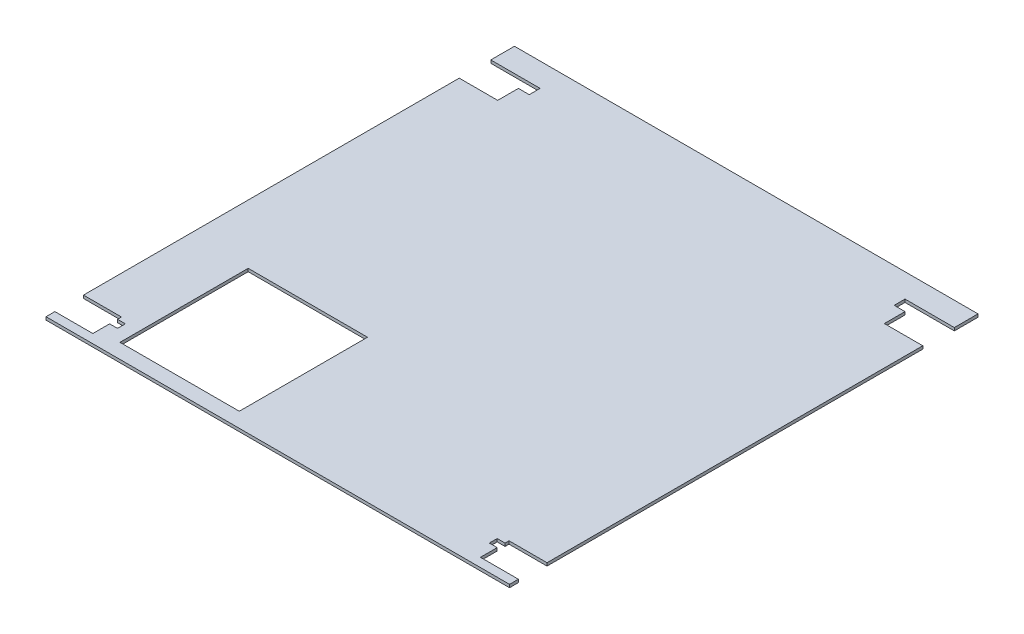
ISO-10303-21;
HEADER;
FILE_DESCRIPTION(('STEP AP214'),'2;1');
FILE_NAME('part.step','',(''),(''),'','','');
FILE_SCHEMA(('AUTOMOTIVE_DESIGN { 1 0 10303 214 1 1 1 1 }'));
ENDSEC;
DATA;
#1=APPLICATION_CONTEXT('core data for automotive mechanical design processes');
#2=APPLICATION_PROTOCOL_DEFINITION('international standard','automotive_design',2000,#1);
#3=PRODUCT_CONTEXT('',#1,'mechanical');
#4=PRODUCT('Part','Part','',(#3));
#5=PRODUCT_RELATED_PRODUCT_CATEGORY('part','',(#4));
#6=PRODUCT_DEFINITION_FORMATION('','',#4);
#7=PRODUCT_DEFINITION_CONTEXT('part definition',#1,'design');
#8=PRODUCT_DEFINITION('design','',#6,#7);
#9=PRODUCT_DEFINITION_SHAPE('','',#8);
#10=(LENGTH_UNIT() NAMED_UNIT(*) SI_UNIT(.MILLI.,.METRE.));
#11=(NAMED_UNIT(*) PLANE_ANGLE_UNIT() SI_UNIT($,.RADIAN.));
#12=(NAMED_UNIT(*) SI_UNIT($,.STERADIAN.) SOLID_ANGLE_UNIT());
#13=UNCERTAINTY_MEASURE_WITH_UNIT(LENGTH_MEASURE(1.E-05),#10,'distance_accuracy_value','');
#14=(GEOMETRIC_REPRESENTATION_CONTEXT(3) GLOBAL_UNCERTAINTY_ASSIGNED_CONTEXT((#13)) GLOBAL_UNIT_ASSIGNED_CONTEXT((#10,
#11,#12)) REPRESENTATION_CONTEXT('',''));
#15=CARTESIAN_POINT('',(0.,0.,0.));
#16=DIRECTION('',(0.,0.,1.));
#17=DIRECTION('',(1.,0.,0.));
#18=AXIS2_PLACEMENT_3D('',#15,#16,#17);
#19=CARTESIAN_POINT('',(0.,3.,0.));
#20=DIRECTION('',(0.,-1.,0.));
#21=DIRECTION('',(0.,0.,-1.));
#22=AXIS2_PLACEMENT_3D('',#19,#20,#21);
#23=PLANE('',#22);
#24=DIRECTION('',(0.,0.,1.));
#25=VECTOR('',#24,1.);
#26=CARTESIAN_POINT('',(420.,3.,0.));
#27=LINE('',#26,#25);
#28=CARTESIAN_POINT('',(420.,3.,-451.));
#29=VERTEX_POINT('',#28);
#30=CARTESIAN_POINT('',(420.,3.,-440.));
#31=VERTEX_POINT('',#30);
#32=EDGE_CURVE('E298',#29,#31,#27,.T.);
#33=ORIENTED_EDGE('',*,*,#32,.F.);
#34=DIRECTION('',(-1.,0.,0.));
#35=VECTOR('',#34,1.);
#36=CARTESIAN_POINT('',(470.,3.,-451.));
#37=LINE('',#36,#35);
#38=CARTESIAN_POINT('',(470.,3.,-451.));
#39=VERTEX_POINT('',#38);
#40=EDGE_CURVE('E295',#39,#29,#37,.T.);
#41=ORIENTED_EDGE('',*,*,#40,.F.);
#42=DIRECTION('',(0.,0.,-1.));
#43=VECTOR('',#42,1.);
#44=CARTESIAN_POINT('',(470.,3.,0.));
#45=LINE('',#44,#43);
#46=CARTESIAN_POINT('',(470.,3.,-475.));
#47=VERTEX_POINT('',#46);
#48=EDGE_CURVE('E803',#39,#47,#45,.T.);
#49=ORIENTED_EDGE('',*,*,#48,.T.);
#50=DIRECTION('',(-1.,0.,0.));
#51=VECTOR('',#50,1.);
#52=CARTESIAN_POINT('',(0.,3.,-475.));
#53=LINE('',#52,#51);
#54=CARTESIAN_POINT('',(0.,3.,-475.));
#55=VERTEX_POINT('',#54);
#56=EDGE_CURVE('E777',#47,#55,#53,.T.);
#57=ORIENTED_EDGE('',*,*,#56,.T.);
#58=DIRECTION('',(0.,0.,1.));
#59=VECTOR('',#58,1.);
#60=CARTESIAN_POINT('',(0.,3.,0.));
#61=LINE('',#60,#59);
#62=CARTESIAN_POINT('',(0.,3.,-451.));
#63=VERTEX_POINT('',#62);
#64=EDGE_CURVE('E441',#55,#63,#61,.T.);
#65=ORIENTED_EDGE('',*,*,#64,.T.);
#66=DIRECTION('',(1.,0.,0.));
#67=VECTOR('',#66,1.);
#68=CARTESIAN_POINT('',(0.,3.,-451.));
#69=LINE('',#68,#67);
#70=CARTESIAN_POINT('',(50.,3.,-451.));
#71=VERTEX_POINT('',#70);
#72=EDGE_CURVE('E362',#63,#71,#69,.T.);
#73=ORIENTED_EDGE('',*,*,#72,.T.);
#74=DIRECTION('',(0.,0.,1.));
#75=VECTOR('',#74,1.);
#76=CARTESIAN_POINT('',(50.,3.,0.));
#77=LINE('',#76,#75);
#78=CARTESIAN_POINT('',(50.,3.,-440.));
#79=VERTEX_POINT('',#78);
#80=EDGE_CURVE('E357',#71,#79,#77,.T.);
#81=ORIENTED_EDGE('',*,*,#80,.T.);
#82=DIRECTION('',(1.,0.,0.));
#83=VECTOR('',#82,1.);
#84=CARTESIAN_POINT('',(0.,3.,-440.));
#85=LINE('',#84,#83);
#86=CARTESIAN_POINT('',(39.,3.,-440.));
#87=VERTEX_POINT('',#86);
#88=EDGE_CURVE('E374',#87,#79,#85,.T.);
#89=ORIENTED_EDGE('',*,*,#88,.F.);
#90=DIRECTION('',(0.,0.,1.));
#91=VECTOR('',#90,1.);
#92=CARTESIAN_POINT('',(39.0000000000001,3.,0.));
#93=LINE('',#92,#91);
#94=CARTESIAN_POINT('',(39.,3.,-419.));
#95=VERTEX_POINT('',#94);
#96=EDGE_CURVE('E380',#87,#95,#93,.T.);
#97=ORIENTED_EDGE('',*,*,#96,.T.);
#98=DIRECTION('',(1.,0.,0.));
#99=VECTOR('',#98,1.);
#100=CARTESIAN_POINT('',(0.,3.,-419.));
#101=LINE('',#100,#99);
#102=CARTESIAN_POINT('',(0.,3.,-419.));
#103=VERTEX_POINT('',#102);
#104=EDGE_CURVE('E823',#103,#95,#101,.T.);
#105=ORIENTED_EDGE('',*,*,#104,.F.);
#106=CARTESIAN_POINT('',(0.,3.,-38.));
#107=VERTEX_POINT('',#106);
#108=EDGE_CURVE('E447',#103,#107,#61,.T.);
#109=ORIENTED_EDGE('',*,*,#108,.T.);
#110=DIRECTION('',(1.,0.,0.));
#111=VECTOR('',#110,1.);
#112=CARTESIAN_POINT('',(0.,3.,-38.));
#113=LINE('',#112,#111);
#114=CARTESIAN_POINT('',(38.5,3.,-38.));
#115=VERTEX_POINT('',#114);
#116=EDGE_CURVE('E363',#107,#115,#113,.T.);
#117=ORIENTED_EDGE('',*,*,#116,.T.);
#118=DIRECTION('',(0.,0.,-1.));
#119=VECTOR('',#118,1.);
#120=CARTESIAN_POINT('',(38.5,3.,-34.));
#121=LINE('',#120,#119);
#122=CARTESIAN_POINT('',(38.5,3.,-34.));
#123=VERTEX_POINT('',#122);
#124=EDGE_CURVE('E462',#123,#115,#121,.T.);
#125=ORIENTED_EDGE('',*,*,#124,.F.);
#126=DIRECTION('',(1.,0.,0.));
#127=VECTOR('',#126,1.);
#128=CARTESIAN_POINT('',(38.5,3.,-34.));
#129=LINE('',#128,#127);
#130=CARTESIAN_POINT('',(46.5,3.,-34.));
#131=VERTEX_POINT('',#130);
#132=EDGE_CURVE('E466',#123,#131,#129,.T.);
#133=ORIENTED_EDGE('',*,*,#132,.T.);
#134=DIRECTION('',(0.,0.,1.));
#135=VECTOR('',#134,1.);
#136=CARTESIAN_POINT('',(46.5,3.,-34.));
#137=LINE('',#136,#135);
#138=CARTESIAN_POINT('',(46.5,3.,-26.));
#139=VERTEX_POINT('',#138);
#140=EDGE_CURVE('E471',#131,#139,#137,.T.);
#141=ORIENTED_EDGE('',*,*,#140,.T.);
#142=DIRECTION('',(1.,0.,0.));
#143=VECTOR('',#142,1.);
#144=CARTESIAN_POINT('',(38.5,3.,-26.));
#145=LINE('',#144,#143);
#146=CARTESIAN_POINT('',(38.5,3.,-26.));
#147=VERTEX_POINT('',#146);
#148=EDGE_CURVE('E475',#147,#139,#145,.T.);
#149=ORIENTED_EDGE('',*,*,#148,.F.);
#150=DIRECTION('',(0.,0.,-1.));
#151=VECTOR('',#150,1.);
#152=CARTESIAN_POINT('',(38.5,3.,-9.));
#153=LINE('',#152,#151);
#154=CARTESIAN_POINT('',(38.5,3.,-9.));
#155=VERTEX_POINT('',#154);
#156=EDGE_CURVE('E430',#155,#147,#153,.T.);
#157=ORIENTED_EDGE('',*,*,#156,.F.);
#158=DIRECTION('',(1.,0.,0.));
#159=VECTOR('',#158,1.);
#160=CARTESIAN_POINT('',(0.,3.,-9.));
#161=LINE('',#160,#159);
#162=CARTESIAN_POINT('',(0.,3.,-9.));
#163=VERTEX_POINT('',#162);
#164=EDGE_CURVE('E425',#163,#155,#161,.T.);
#165=ORIENTED_EDGE('',*,*,#164,.F.);
#166=CARTESIAN_POINT('',(0.,3.,0.));
#167=VERTEX_POINT('',#166);
#168=EDGE_CURVE('E448',#163,#167,#61,.T.);
#169=ORIENTED_EDGE('',*,*,#168,.T.);
#170=DIRECTION('',(1.,0.,0.));
#171=VECTOR('',#170,1.);
#172=CARTESIAN_POINT('',(0.,3.,0.));
#173=LINE('',#172,#171);
#174=CARTESIAN_POINT('',(470.,3.,0.));
#175=VERTEX_POINT('',#174);
#176=EDGE_CURVE('E446',#167,#175,#173,.T.);
#177=ORIENTED_EDGE('',*,*,#176,.T.);
#178=CARTESIAN_POINT('',(470.,3.,-9.));
#179=VERTEX_POINT('',#178);
#180=EDGE_CURVE('E757',#175,#179,#45,.T.);
#181=ORIENTED_EDGE('',*,*,#180,.T.);
#182=DIRECTION('',(-1.,0.,0.));
#183=VECTOR('',#182,1.);
#184=CARTESIAN_POINT('',(470.,3.,-9.));
#185=LINE('',#184,#183);
#186=CARTESIAN_POINT('',(431.5,3.,-9.));
#187=VERTEX_POINT('',#186);
#188=EDGE_CURVE('E614',#179,#187,#185,.T.);
#189=ORIENTED_EDGE('',*,*,#188,.T.);
#190=DIRECTION('',(0.,0.,-1.));
#191=VECTOR('',#190,1.);
#192=CARTESIAN_POINT('',(431.5,3.,-9.));
#193=LINE('',#192,#191);
#194=CARTESIAN_POINT('',(431.5,3.,-26.));
#195=VERTEX_POINT('',#194);
#196=EDGE_CURVE('E619',#187,#195,#193,.T.);
#197=ORIENTED_EDGE('',*,*,#196,.T.);
#198=DIRECTION('',(-1.,0.,0.));
#199=VECTOR('',#198,1.);
#200=CARTESIAN_POINT('',(431.5,3.,-26.));
#201=LINE('',#200,#199);
#202=CARTESIAN_POINT('',(423.5,3.,-26.));
#203=VERTEX_POINT('',#202);
#204=EDGE_CURVE('E628',#195,#203,#201,.T.);
#205=ORIENTED_EDGE('',*,*,#204,.T.);
#206=DIRECTION('',(0.,0.,1.));
#207=VECTOR('',#206,1.);
#208=CARTESIAN_POINT('',(423.5,3.,-34.));
#209=LINE('',#208,#207);
#210=CARTESIAN_POINT('',(423.5,3.,-34.));
#211=VERTEX_POINT('',#210);
#212=EDGE_CURVE('E632',#211,#203,#209,.T.);
#213=ORIENTED_EDGE('',*,*,#212,.F.);
#214=DIRECTION('',(-1.,0.,0.));
#215=VECTOR('',#214,1.);
#216=CARTESIAN_POINT('',(431.5,3.,-34.));
#217=LINE('',#216,#215);
#218=CARTESIAN_POINT('',(431.5,3.,-34.));
#219=VERTEX_POINT('',#218);
#220=EDGE_CURVE('E637',#219,#211,#217,.T.);
#221=ORIENTED_EDGE('',*,*,#220,.F.);
#222=DIRECTION('',(0.,0.,-1.));
#223=VECTOR('',#222,1.);
#224=CARTESIAN_POINT('',(431.5,3.,-34.));
#225=LINE('',#224,#223);
#226=CARTESIAN_POINT('',(431.5,3.,-38.));
#227=VERTEX_POINT('',#226);
#228=EDGE_CURVE('E642',#219,#227,#225,.T.);
#229=ORIENTED_EDGE('',*,*,#228,.T.);
#230=DIRECTION('',(-1.,0.,0.));
#231=VECTOR('',#230,1.);
#232=CARTESIAN_POINT('',(470.,3.,-38.));
#233=LINE('',#232,#231);
#234=CARTESIAN_POINT('',(470.,3.,-38.));
#235=VERTEX_POINT('',#234);
#236=EDGE_CURVE('E648',#235,#227,#233,.T.);
#237=ORIENTED_EDGE('',*,*,#236,.F.);
#238=CARTESIAN_POINT('',(470.,3.,-419.));
#239=VERTEX_POINT('',#238);
#240=EDGE_CURVE('E802',#235,#239,#45,.T.);
#241=ORIENTED_EDGE('',*,*,#240,.T.);
#242=DIRECTION('',(-1.,0.,0.));
#243=VECTOR('',#242,1.);
#244=CARTESIAN_POINT('',(470.,3.,-419.));
#245=LINE('',#244,#243);
#246=CARTESIAN_POINT('',(431.,3.,-419.));
#247=VERTEX_POINT('',#246);
#248=EDGE_CURVE('E64',#239,#247,#245,.T.);
#249=ORIENTED_EDGE('',*,*,#248,.T.);
#250=DIRECTION('',(0.,0.,1.));
#251=VECTOR('',#250,1.);
#252=CARTESIAN_POINT('',(431.,3.,0.));
#253=LINE('',#252,#251);
#254=CARTESIAN_POINT('',(431.,3.,-440.));
#255=VERTEX_POINT('',#254);
#256=EDGE_CURVE('E310',#255,#247,#253,.T.);
#257=ORIENTED_EDGE('',*,*,#256,.F.);
#258=DIRECTION('',(-1.,0.,0.));
#259=VECTOR('',#258,1.);
#260=CARTESIAN_POINT('',(470.,3.,-440.));
#261=LINE('',#260,#259);
#262=EDGE_CURVE('E287',#255,#31,#261,.T.);
#263=ORIENTED_EDGE('',*,*,#262,.T.);
#264=EDGE_LOOP('',(#33,#41,#49,#57,#65,#73,#81,#89,#97,#105,#109,#117,#125,#133,#141,#149,#157,
#165,#169,#177,#181,#189,#197,#205,#213,#221,#229,#237,#241,#249,#257,#263));
#265=FACE_BOUND('',#264,.T.);
#266=DIRECTION('',(1.,0.,0.));
#267=VECTOR('',#266,1.);
#268=CARTESIAN_POINT('',(60.,3.,-15.));
#269=LINE('',#268,#267);
#270=CARTESIAN_POINT('',(60.,3.,-15.));
#271=VERTEX_POINT('',#270);
#272=CARTESIAN_POINT('',(181.,3.,-15.));
#273=VERTEX_POINT('',#272);
#274=EDGE_CURVE('E326',#271,#273,#269,.T.);
#275=ORIENTED_EDGE('',*,*,#274,.F.);
#276=DIRECTION('',(0.,0.,1.));
#277=VECTOR('',#276,1.);
#278=CARTESIAN_POINT('',(60.,3.,-145.));
#279=LINE('',#278,#277);
#280=CARTESIAN_POINT('',(60.,3.,-145.));
#281=VERTEX_POINT('',#280);
#282=EDGE_CURVE('E331',#281,#271,#279,.T.);
#283=ORIENTED_EDGE('',*,*,#282,.F.);
#284=DIRECTION('',(-1.,0.,0.));
#285=VECTOR('',#284,1.);
#286=CARTESIAN_POINT('',(60.,3.,-145.));
#287=LINE('',#286,#285);
#288=CARTESIAN_POINT('',(181.,3.,-145.));
#289=VERTEX_POINT('',#288);
#290=EDGE_CURVE('E338',#289,#281,#287,.T.);
#291=ORIENTED_EDGE('',*,*,#290,.F.);
#292=DIRECTION('',(0.,0.,-1.));
#293=VECTOR('',#292,1.);
#294=CARTESIAN_POINT('',(181.,3.,-145.));
#295=LINE('',#294,#293);
#296=EDGE_CURVE('E330',#273,#289,#295,.T.);
#297=ORIENTED_EDGE('',*,*,#296,.F.);
#298=EDGE_LOOP('',(#275,#283,#291,#297));
#299=FACE_BOUND('',#298,.T.);
#300=ADVANCED_FACE('F48',(#265,#299),#23,.F.);
#301=CARTESIAN_POINT('',(0.,0.,0.));
#302=DIRECTION('',(0.,-1.,0.));
#303=DIRECTION('',(0.,0.,-1.));
#304=AXIS2_PLACEMENT_3D('',#301,#302,#303);
#305=PLANE('',#304);
#306=DIRECTION('',(1.,0.,0.));
#307=VECTOR('',#306,1.);
#308=CARTESIAN_POINT('',(0.,0.,-451.));
#309=LINE('',#308,#307);
#310=CARTESIAN_POINT('',(420.,0.,-451.));
#311=VERTEX_POINT('',#310);
#312=CARTESIAN_POINT('',(470.,0.,-451.));
#313=VERTEX_POINT('',#312);
#314=EDGE_CURVE('E601',#311,#313,#309,.T.);
#315=ORIENTED_EDGE('',*,*,#314,.F.);
#316=DIRECTION('',(0.,0.,-1.));
#317=VECTOR('',#316,1.);
#318=CARTESIAN_POINT('',(420.,0.,0.));
#319=LINE('',#318,#317);
#320=CARTESIAN_POINT('',(420.,0.,-440.));
#321=VERTEX_POINT('',#320);
#322=EDGE_CURVE('E12',#321,#311,#319,.T.);
#323=ORIENTED_EDGE('',*,*,#322,.F.);
#324=DIRECTION('',(1.,0.,0.));
#325=VECTOR('',#324,1.);
#326=CARTESIAN_POINT('',(0.,0.,-440.));
#327=LINE('',#326,#325);
#328=CARTESIAN_POINT('',(431.,0.,-440.));
#329=VERTEX_POINT('',#328);
#330=EDGE_CURVE('E290',#321,#329,#327,.T.);
#331=ORIENTED_EDGE('',*,*,#330,.T.);
#332=DIRECTION('',(0.,0.,-1.));
#333=VECTOR('',#332,1.);
#334=CARTESIAN_POINT('',(431.,0.,1.42412536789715E-13));
#335=LINE('',#334,#333);
#336=CARTESIAN_POINT('',(431.,0.,-419.));
#337=VERTEX_POINT('',#336);
#338=EDGE_CURVE('E57',#337,#329,#335,.T.);
#339=ORIENTED_EDGE('',*,*,#338,.F.);
#340=DIRECTION('',(1.,0.,0.));
#341=VECTOR('',#340,1.);
#342=CARTESIAN_POINT('',(0.,0.,-419.));
#343=LINE('',#342,#341);
#344=CARTESIAN_POINT('',(470.,0.,-419.));
#345=VERTEX_POINT('',#344);
#346=EDGE_CURVE('E673',#337,#345,#343,.T.);
#347=ORIENTED_EDGE('',*,*,#346,.T.);
#348=DIRECTION('',(0.,0.,-1.));
#349=VECTOR('',#348,1.);
#350=CARTESIAN_POINT('',(470.,0.,0.));
#351=LINE('',#350,#349);
#352=CARTESIAN_POINT('',(470.,0.,-38.));
#353=VERTEX_POINT('',#352);
#354=EDGE_CURVE('E763',#353,#345,#351,.T.);
#355=ORIENTED_EDGE('',*,*,#354,.F.);
#356=DIRECTION('',(1.,0.,0.));
#357=VECTOR('',#356,1.);
#358=CARTESIAN_POINT('',(0.,0.,-38.));
#359=LINE('',#358,#357);
#360=CARTESIAN_POINT('',(431.5,0.,-38.));
#361=VERTEX_POINT('',#360);
#362=EDGE_CURVE('E72',#361,#353,#359,.T.);
#363=ORIENTED_EDGE('',*,*,#362,.F.);
#364=DIRECTION('',(0.,0.,1.));
#365=VECTOR('',#364,1.);
#366=CARTESIAN_POINT('',(431.5,0.,0.));
#367=LINE('',#366,#365);
#368=CARTESIAN_POINT('',(431.5,0.,-34.));
#369=VERTEX_POINT('',#368);
#370=EDGE_CURVE('E572',#361,#369,#367,.T.);
#371=ORIENTED_EDGE('',*,*,#370,.T.);
#372=DIRECTION('',(1.,0.,0.));
#373=VECTOR('',#372,1.);
#374=CARTESIAN_POINT('',(0.,0.,-34.));
#375=LINE('',#374,#373);
#376=CARTESIAN_POINT('',(423.5,0.,-34.));
#377=VERTEX_POINT('',#376);
#378=EDGE_CURVE('E576',#377,#369,#375,.T.);
#379=ORIENTED_EDGE('',*,*,#378,.F.);
#380=DIRECTION('',(0.,0.,-1.));
#381=VECTOR('',#380,1.);
#382=CARTESIAN_POINT('',(423.5,0.,0.));
#383=LINE('',#382,#381);
#384=CARTESIAN_POINT('',(423.5,0.,-26.));
#385=VERTEX_POINT('',#384);
#386=EDGE_CURVE('E579',#385,#377,#383,.T.);
#387=ORIENTED_EDGE('',*,*,#386,.F.);
#388=DIRECTION('',(1.,0.,0.));
#389=VECTOR('',#388,1.);
#390=CARTESIAN_POINT('',(0.,0.,-26.));
#391=LINE('',#390,#389);
#392=CARTESIAN_POINT('',(431.5,0.,-26.));
#393=VERTEX_POINT('',#392);
#394=EDGE_CURVE('E582',#385,#393,#391,.T.);
#395=ORIENTED_EDGE('',*,*,#394,.T.);
#396=DIRECTION('',(0.,0.,1.));
#397=VECTOR('',#396,1.);
#398=CARTESIAN_POINT('',(431.5,0.,0.));
#399=LINE('',#398,#397);
#400=CARTESIAN_POINT('',(431.5,0.,-9.));
#401=VERTEX_POINT('',#400);
#402=EDGE_CURVE('E586',#393,#401,#399,.T.);
#403=ORIENTED_EDGE('',*,*,#402,.T.);
#404=DIRECTION('',(1.,0.,0.));
#405=VECTOR('',#404,1.);
#406=CARTESIAN_POINT('',(0.,0.,-9.));
#407=LINE('',#406,#405);
#408=CARTESIAN_POINT('',(470.,0.,-9.));
#409=VERTEX_POINT('',#408);
#410=EDGE_CURVE('E608',#401,#409,#407,.T.);
#411=ORIENTED_EDGE('',*,*,#410,.T.);
#412=CARTESIAN_POINT('',(470.,0.,0.));
#413=VERTEX_POINT('',#412);
#414=EDGE_CURVE('E755',#413,#409,#351,.T.);
#415=ORIENTED_EDGE('',*,*,#414,.F.);
#416=DIRECTION('',(1.,0.,0.));
#417=VECTOR('',#416,1.);
#418=CARTESIAN_POINT('',(0.,0.,0.));
#419=LINE('',#418,#417);
#420=CARTESIAN_POINT('',(0.,0.,0.));
#421=VERTEX_POINT('',#420);
#422=EDGE_CURVE('E739',#421,#413,#419,.T.);
#423=ORIENTED_EDGE('',*,*,#422,.F.);
#424=DIRECTION('',(0.,0.,1.));
#425=VECTOR('',#424,1.);
#426=CARTESIAN_POINT('',(0.,0.,0.));
#427=LINE('',#426,#425);
#428=CARTESIAN_POINT('',(0.,0.,-9.));
#429=VERTEX_POINT('',#428);
#430=EDGE_CURVE('E385',#429,#421,#427,.T.);
#431=ORIENTED_EDGE('',*,*,#430,.F.);
#432=DIRECTION('',(-1.,0.,0.));
#433=VECTOR('',#432,1.);
#434=CARTESIAN_POINT('',(0.,0.,-9.));
#435=LINE('',#434,#433);
#436=CARTESIAN_POINT('',(38.5,0.,-9.));
#437=VERTEX_POINT('',#436);
#438=EDGE_CURVE('E515',#437,#429,#435,.T.);
#439=ORIENTED_EDGE('',*,*,#438,.F.);
#440=DIRECTION('',(0.,0.,1.));
#441=VECTOR('',#440,1.);
#442=CARTESIAN_POINT('',(38.5,0.,0.));
#443=LINE('',#442,#441);
#444=CARTESIAN_POINT('',(38.5,0.,-26.));
#445=VERTEX_POINT('',#444);
#446=EDGE_CURVE('E508',#445,#437,#443,.T.);
#447=ORIENTED_EDGE('',*,*,#446,.F.);
#448=DIRECTION('',(-1.,0.,0.));
#449=VECTOR('',#448,1.);
#450=CARTESIAN_POINT('',(0.,0.,-26.));
#451=LINE('',#450,#449);
#452=CARTESIAN_POINT('',(46.5,0.,-26.));
#453=VERTEX_POINT('',#452);
#454=EDGE_CURVE('E501',#453,#445,#451,.T.);
#455=ORIENTED_EDGE('',*,*,#454,.F.);
#456=DIRECTION('',(0.,0.,-1.));
#457=VECTOR('',#456,1.);
#458=CARTESIAN_POINT('',(46.5,0.,0.));
#459=LINE('',#458,#457);
#460=CARTESIAN_POINT('',(46.5,0.,-34.));
#461=VERTEX_POINT('',#460);
#462=EDGE_CURVE('E498',#453,#461,#459,.T.);
#463=ORIENTED_EDGE('',*,*,#462,.T.);
#464=DIRECTION('',(-1.,0.,0.));
#465=VECTOR('',#464,1.);
#466=CARTESIAN_POINT('',(0.,0.,-34.));
#467=LINE('',#466,#465);
#468=CARTESIAN_POINT('',(38.5,0.,-34.));
#469=VERTEX_POINT('',#468);
#470=EDGE_CURVE('E513',#461,#469,#467,.T.);
#471=ORIENTED_EDGE('',*,*,#470,.T.);
#472=DIRECTION('',(0.,0.,1.));
#473=VECTOR('',#472,1.);
#474=CARTESIAN_POINT('',(38.5,0.,0.));
#475=LINE('',#474,#473);
#476=CARTESIAN_POINT('',(38.5,0.,-38.));
#477=VERTEX_POINT('',#476);
#478=EDGE_CURVE('E521',#477,#469,#475,.T.);
#479=ORIENTED_EDGE('',*,*,#478,.F.);
#480=DIRECTION('',(-1.,0.,0.));
#481=VECTOR('',#480,1.);
#482=CARTESIAN_POINT('',(0.,0.,-38.));
#483=LINE('',#482,#481);
#484=CARTESIAN_POINT('',(0.,0.,-38.));
#485=VERTEX_POINT('',#484);
#486=EDGE_CURVE('E524',#477,#485,#483,.T.);
#487=ORIENTED_EDGE('',*,*,#486,.T.);
#488=CARTESIAN_POINT('',(0.,0.,-419.));
#489=VERTEX_POINT('',#488);
#490=EDGE_CURVE('E785',#489,#485,#427,.T.);
#491=ORIENTED_EDGE('',*,*,#490,.F.);
#492=DIRECTION('',(-1.,0.,0.));
#493=VECTOR('',#492,1.);
#494=CARTESIAN_POINT('',(0.,0.,-419.));
#495=LINE('',#494,#493);
#496=CARTESIAN_POINT('',(39.,0.,-419.));
#497=VERTEX_POINT('',#496);
#498=EDGE_CURVE('E543',#497,#489,#495,.T.);
#499=ORIENTED_EDGE('',*,*,#498,.F.);
#500=DIRECTION('',(0.,0.,-1.));
#501=VECTOR('',#500,1.);
#502=CARTESIAN_POINT('',(39.0000000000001,0.,0.));
#503=LINE('',#502,#501);
#504=CARTESIAN_POINT('',(39.,0.,-440.));
#505=VERTEX_POINT('',#504);
#506=EDGE_CURVE('E539',#497,#505,#503,.T.);
#507=ORIENTED_EDGE('',*,*,#506,.T.);
#508=DIRECTION('',(-1.,0.,0.));
#509=VECTOR('',#508,1.);
#510=CARTESIAN_POINT('',(0.,0.,-440.));
#511=LINE('',#510,#509);
#512=CARTESIAN_POINT('',(50.,0.,-440.));
#513=VERTEX_POINT('',#512);
#514=EDGE_CURVE('E536',#513,#505,#511,.T.);
#515=ORIENTED_EDGE('',*,*,#514,.F.);
#516=DIRECTION('',(0.,0.,-1.));
#517=VECTOR('',#516,1.);
#518=CARTESIAN_POINT('',(50.,0.,0.));
#519=LINE('',#518,#517);
#520=CARTESIAN_POINT('',(50.,0.,-451.));
#521=VERTEX_POINT('',#520);
#522=EDGE_CURVE('E532',#513,#521,#519,.T.);
#523=ORIENTED_EDGE('',*,*,#522,.T.);
#524=DIRECTION('',(-1.,0.,0.));
#525=VECTOR('',#524,1.);
#526=CARTESIAN_POINT('',(0.,0.,-451.));
#527=LINE('',#526,#525);
#528=CARTESIAN_POINT('',(0.,0.,-451.));
#529=VERTEX_POINT('',#528);
#530=EDGE_CURVE('E528',#521,#529,#527,.T.);
#531=ORIENTED_EDGE('',*,*,#530,.T.);
#532=CARTESIAN_POINT('',(0.,0.,-475.));
#533=VERTEX_POINT('',#532);
#534=EDGE_CURVE('E750',#533,#529,#427,.T.);
#535=ORIENTED_EDGE('',*,*,#534,.F.);
#536=DIRECTION('',(-1.,0.,0.));
#537=VECTOR('',#536,1.);
#538=CARTESIAN_POINT('',(0.,0.,-475.));
#539=LINE('',#538,#537);
#540=CARTESIAN_POINT('',(470.,0.,-475.));
#541=VERTEX_POINT('',#540);
#542=EDGE_CURVE('E762',#541,#533,#539,.T.);
#543=ORIENTED_EDGE('',*,*,#542,.F.);
#544=EDGE_CURVE('E749',#313,#541,#351,.T.);
#545=ORIENTED_EDGE('',*,*,#544,.F.);
#546=EDGE_LOOP('',(#315,#323,#331,#339,#347,#355,#363,#371,#379,#387,#395,#403,#411,#415,#423,
#431,#439,#447,#455,#463,#471,#479,#487,#491,#499,#507,#515,#523,#531,#535,#543,#545));
#547=FACE_BOUND('',#546,.T.);
#548=DIRECTION('',(0.,0.,-1.));
#549=VECTOR('',#548,1.);
#550=CARTESIAN_POINT('',(60.,0.,0.));
#551=LINE('',#550,#549);
#552=CARTESIAN_POINT('',(60.,0.,-15.));
#553=VERTEX_POINT('',#552);
#554=CARTESIAN_POINT('',(60.,0.,-145.));
#555=VERTEX_POINT('',#554);
#556=EDGE_CURVE('E556',#553,#555,#551,.T.);
#557=ORIENTED_EDGE('',*,*,#556,.F.);
#558=DIRECTION('',(-1.,0.,0.));
#559=VECTOR('',#558,1.);
#560=CARTESIAN_POINT('',(0.,0.,-15.));
#561=LINE('',#560,#559);
#562=CARTESIAN_POINT('',(181.,0.,-15.));
#563=VERTEX_POINT('',#562);
#564=EDGE_CURVE('E546',#563,#553,#561,.T.);
#565=ORIENTED_EDGE('',*,*,#564,.F.);
#566=DIRECTION('',(0.,0.,1.));
#567=VECTOR('',#566,1.);
#568=CARTESIAN_POINT('',(181.,0.,0.));
#569=LINE('',#568,#567);
#570=CARTESIAN_POINT('',(181.,0.,-145.));
#571=VERTEX_POINT('',#570);
#572=EDGE_CURVE('E549',#571,#563,#569,.T.);
#573=ORIENTED_EDGE('',*,*,#572,.F.);
#574=DIRECTION('',(1.,0.,0.));
#575=VECTOR('',#574,1.);
#576=CARTESIAN_POINT('',(0.,0.,-145.));
#577=LINE('',#576,#575);
#578=EDGE_CURVE('E553',#555,#571,#577,.T.);
#579=ORIENTED_EDGE('',*,*,#578,.F.);
#580=EDGE_LOOP('',(#557,#565,#573,#579));
#581=FACE_BOUND('',#580,.T.);
#582=ADVANCED_FACE('F504',(#547,#581),#305,.T.);
#583=CARTESIAN_POINT('',(470.,3.,0.));
#584=DIRECTION('',(-1.,0.,0.));
#585=DIRECTION('',(0.,0.,1.));
#586=AXIS2_PLACEMENT_3D('',#583,#584,#585);
#587=PLANE('',#586);
#588=DIRECTION('',(0.,-1.,0.));
#589=VECTOR('',#588,1.);
#590=CARTESIAN_POINT('',(470.,3.,-419.));
#591=LINE('',#590,#589);
#592=EDGE_CURVE('E565',#239,#345,#591,.T.);
#593=ORIENTED_EDGE('',*,*,#592,.F.);
#594=ORIENTED_EDGE('',*,*,#240,.F.);
#595=DIRECTION('',(0.,-1.,0.));
#596=VECTOR('',#595,1.);
#597=CARTESIAN_POINT('',(470.,3.,-38.));
#598=LINE('',#597,#596);
#599=EDGE_CURVE('E559',#235,#353,#598,.T.);
#600=ORIENTED_EDGE('',*,*,#599,.T.);
#601=ORIENTED_EDGE('',*,*,#354,.T.);
#602=EDGE_LOOP('',(#593,#594,#600,#601));
#603=FACE_BOUND('',#602,.T.);
#604=ADVANCED_FACE('F712',(#603),#587,.F.);
#605=DIRECTION('',(0.,-1.,0.));
#606=VECTOR('',#605,1.);
#607=CARTESIAN_POINT('',(470.,3.,-9.));
#608=LINE('',#607,#606);
#609=EDGE_CURVE('E562',#179,#409,#608,.T.);
#610=ORIENTED_EDGE('',*,*,#609,.F.);
#611=ORIENTED_EDGE('',*,*,#180,.F.);
#612=DIRECTION('',(0.,-1.,0.));
#613=VECTOR('',#612,1.);
#614=CARTESIAN_POINT('',(470.,3.,0.));
#615=LINE('',#614,#613);
#616=EDGE_CURVE('E742',#175,#413,#615,.T.);
#617=ORIENTED_EDGE('',*,*,#616,.T.);
#618=ORIENTED_EDGE('',*,*,#414,.T.);
#619=EDGE_LOOP('',(#610,#611,#617,#618));
#620=FACE_BOUND('',#619,.T.);
#621=ADVANCED_FACE('F727',(#620),#587,.F.);
#622=CARTESIAN_POINT('',(0.,3.,0.));
#623=DIRECTION('',(1.,0.,0.));
#624=DIRECTION('',(0.,0.,-1.));
#625=AXIS2_PLACEMENT_3D('',#622,#623,#624);
#626=PLANE('',#625);
#627=DIRECTION('',(0.,1.,0.));
#628=VECTOR('',#627,1.);
#629=CARTESIAN_POINT('',(0.,-1.2E-05,-451.));
#630=LINE('',#629,#628);
#631=EDGE_CURVE('E395',#529,#63,#630,.T.);
#632=ORIENTED_EDGE('',*,*,#631,.T.);
#633=ORIENTED_EDGE('',*,*,#64,.F.);
#634=DIRECTION('',(0.,-1.,0.));
#635=VECTOR('',#634,1.);
#636=CARTESIAN_POINT('',(0.,3.,-475.));
#637=LINE('',#636,#635);
#638=EDGE_CURVE('E779',#55,#533,#637,.T.);
#639=ORIENTED_EDGE('',*,*,#638,.T.);
#640=ORIENTED_EDGE('',*,*,#534,.T.);
#641=EDGE_LOOP('',(#632,#633,#639,#640));
#642=FACE_BOUND('',#641,.T.);
#643=ADVANCED_FACE('F735',(#642),#626,.F.);
#644=ORIENTED_EDGE('',*,*,#108,.F.);
#645=DIRECTION('',(0.,1.,0.));
#646=VECTOR('',#645,1.);
#647=CARTESIAN_POINT('',(0.,-1.2E-05,-419.));
#648=LINE('',#647,#646);
#649=EDGE_CURVE('E392',#489,#103,#648,.T.);
#650=ORIENTED_EDGE('',*,*,#649,.F.);
#651=ORIENTED_EDGE('',*,*,#490,.T.);
#652=DIRECTION('',(0.,1.,0.));
#653=VECTOR('',#652,1.);
#654=CARTESIAN_POINT('',(0.,-1.2E-05,-38.));
#655=LINE('',#654,#653);
#656=EDGE_CURVE('E347',#485,#107,#655,.T.);
#657=ORIENTED_EDGE('',*,*,#656,.T.);
#658=EDGE_LOOP('',(#644,#650,#651,#657));
#659=FACE_BOUND('',#658,.T.);
#660=ADVANCED_FACE('F733',(#659),#626,.F.);
#661=ORIENTED_EDGE('',*,*,#168,.F.);
#662=DIRECTION('',(0.,1.,0.));
#663=VECTOR('',#662,1.);
#664=CARTESIAN_POINT('',(0.,-1.2E-05,-9.));
#665=LINE('',#664,#663);
#666=EDGE_CURVE('E422',#429,#163,#665,.T.);
#667=ORIENTED_EDGE('',*,*,#666,.F.);
#668=ORIENTED_EDGE('',*,*,#430,.T.);
#669=DIRECTION('',(0.,-1.,0.));
#670=VECTOR('',#669,1.);
#671=CARTESIAN_POINT('',(0.,3.,0.));
#672=LINE('',#671,#670);
#673=EDGE_CURVE('E745',#167,#421,#672,.T.);
#674=ORIENTED_EDGE('',*,*,#673,.F.);
#675=EDGE_LOOP('',(#661,#667,#668,#674));
#676=FACE_BOUND('',#675,.T.);
#677=ADVANCED_FACE('F50',(#676),#626,.F.);
#678=CARTESIAN_POINT('',(0.,3.,0.));
#679=DIRECTION('',(0.,0.,-1.));
#680=DIRECTION('',(-1.,0.,0.));
#681=AXIS2_PLACEMENT_3D('',#678,#679,#680);
#682=PLANE('',#681);
#683=ORIENTED_EDGE('',*,*,#422,.T.);
#684=ORIENTED_EDGE('',*,*,#616,.F.);
#685=ORIENTED_EDGE('',*,*,#176,.F.);
#686=ORIENTED_EDGE('',*,*,#673,.T.);
#687=EDGE_LOOP('',(#683,#684,#685,#686));
#688=FACE_BOUND('',#687,.T.);
#689=ADVANCED_FACE('F725',(#688),#682,.F.);
#690=ORIENTED_EDGE('',*,*,#48,.F.);
#691=DIRECTION('',(0.,-1.,0.));
#692=VECTOR('',#691,1.);
#693=CARTESIAN_POINT('',(470.,3.,-451.));
#694=LINE('',#693,#692);
#695=EDGE_CURVE('E568',#39,#313,#694,.T.);
#696=ORIENTED_EDGE('',*,*,#695,.T.);
#697=ORIENTED_EDGE('',*,*,#544,.T.);
#698=DIRECTION('',(0.,-1.,0.));
#699=VECTOR('',#698,1.);
#700=CARTESIAN_POINT('',(470.,3.,-475.));
#701=LINE('',#700,#699);
#702=EDGE_CURVE('E759',#47,#541,#701,.T.);
#703=ORIENTED_EDGE('',*,*,#702,.F.);
#704=EDGE_LOOP('',(#690,#696,#697,#703));
#705=FACE_BOUND('',#704,.T.);
#706=ADVANCED_FACE('F722',(#705),#587,.F.);
#707=CARTESIAN_POINT('',(0.,3.,-475.));
#708=DIRECTION('',(0.,0.,1.));
#709=DIRECTION('',(1.,0.,0.));
#710=AXIS2_PLACEMENT_3D('',#707,#708,#709);
#711=PLANE('',#710);
#712=ORIENTED_EDGE('',*,*,#542,.T.);
#713=ORIENTED_EDGE('',*,*,#638,.F.);
#714=ORIENTED_EDGE('',*,*,#56,.F.);
#715=ORIENTED_EDGE('',*,*,#702,.T.);
#716=EDGE_LOOP('',(#712,#713,#714,#715));
#717=FACE_BOUND('',#716,.T.);
#718=ADVANCED_FACE('F718',(#717),#711,.F.);
#719=CARTESIAN_POINT('',(0.,-1.2E-05,-38.));
#720=DIRECTION('',(0.,0.,1.));
#721=DIRECTION('',(1.,0.,0.));
#722=AXIS2_PLACEMENT_3D('',#719,#720,#721);
#723=PLANE('',#722);
#724=DIRECTION('',(0.,1.,0.));
#725=VECTOR('',#724,1.);
#726=CARTESIAN_POINT('',(38.5,-1.2E-05,-38.));
#727=LINE('',#726,#725);
#728=EDGE_CURVE('E404',#477,#115,#727,.T.);
#729=ORIENTED_EDGE('',*,*,#728,.T.);
#730=ORIENTED_EDGE('',*,*,#116,.F.);
#731=ORIENTED_EDGE('',*,*,#656,.F.);
#732=ORIENTED_EDGE('',*,*,#486,.F.);
#733=EDGE_LOOP('',(#729,#730,#731,#732));
#734=FACE_BOUND('',#733,.T.);
#735=ADVANCED_FACE('F721',(#734),#723,.T.);
#736=CARTESIAN_POINT('',(38.5,-1.2E-05,-34.));
#737=DIRECTION('',(1.,0.,0.));
#738=DIRECTION('',(0.,0.,-1.));
#739=AXIS2_PLACEMENT_3D('',#736,#737,#738);
#740=PLANE('',#739);
#741=ORIENTED_EDGE('',*,*,#478,.T.);
#742=DIRECTION('',(0.,1.,0.));
#743=VECTOR('',#742,1.);
#744=CARTESIAN_POINT('',(38.5,-1.2E-05,-34.));
#745=LINE('',#744,#743);
#746=EDGE_CURVE('E407',#469,#123,#745,.T.);
#747=ORIENTED_EDGE('',*,*,#746,.T.);
#748=ORIENTED_EDGE('',*,*,#124,.T.);
#749=ORIENTED_EDGE('',*,*,#728,.F.);
#750=EDGE_LOOP('',(#741,#747,#748,#749));
#751=FACE_BOUND('',#750,.T.);
#752=ADVANCED_FACE('F833',(#751),#740,.F.);
#753=CARTESIAN_POINT('',(38.5,-1.2E-05,-34.));
#754=DIRECTION('',(0.,0.,1.));
#755=DIRECTION('',(1.,0.,0.));
#756=AXIS2_PLACEMENT_3D('',#753,#754,#755);
#757=PLANE('',#756);
#758=DIRECTION('',(0.,1.,0.));
#759=VECTOR('',#758,1.);
#760=CARTESIAN_POINT('',(46.5,-1.2E-05,-34.));
#761=LINE('',#760,#759);
#762=EDGE_CURVE('E410',#461,#131,#761,.T.);
#763=ORIENTED_EDGE('',*,*,#762,.T.);
#764=ORIENTED_EDGE('',*,*,#132,.F.);
#765=ORIENTED_EDGE('',*,*,#746,.F.);
#766=ORIENTED_EDGE('',*,*,#470,.F.);
#767=EDGE_LOOP('',(#763,#764,#765,#766));
#768=FACE_BOUND('',#767,.T.);
#769=ADVANCED_FACE('F835',(#768),#757,.T.);
#770=CARTESIAN_POINT('',(46.5,-1.2E-05,-34.));
#771=DIRECTION('',(-1.,0.,0.));
#772=DIRECTION('',(0.,0.,1.));
#773=AXIS2_PLACEMENT_3D('',#770,#771,#772);
#774=PLANE('',#773);
#775=DIRECTION('',(0.,1.,0.));
#776=VECTOR('',#775,1.);
#777=CARTESIAN_POINT('',(46.5,-1.2E-05,-26.));
#778=LINE('',#777,#776);
#779=EDGE_CURVE('E413',#453,#139,#778,.T.);
#780=ORIENTED_EDGE('',*,*,#779,.T.);
#781=ORIENTED_EDGE('',*,*,#140,.F.);
#782=ORIENTED_EDGE('',*,*,#762,.F.);
#783=ORIENTED_EDGE('',*,*,#462,.F.);
#784=EDGE_LOOP('',(#780,#781,#782,#783));
#785=FACE_BOUND('',#784,.T.);
#786=ADVANCED_FACE('F496',(#785),#774,.T.);
#787=CARTESIAN_POINT('',(38.5,-1.2E-05,-26.));
#788=DIRECTION('',(0.,0.,1.));
#789=DIRECTION('',(1.,0.,0.));
#790=AXIS2_PLACEMENT_3D('',#787,#788,#789);
#791=PLANE('',#790);
#792=ORIENTED_EDGE('',*,*,#454,.T.);
#793=DIRECTION('',(0.,1.,0.));
#794=VECTOR('',#793,1.);
#795=CARTESIAN_POINT('',(38.5,-1.2E-05,-26.));
#796=LINE('',#795,#794);
#797=EDGE_CURVE('E416',#445,#147,#796,.T.);
#798=ORIENTED_EDGE('',*,*,#797,.T.);
#799=ORIENTED_EDGE('',*,*,#148,.T.);
#800=ORIENTED_EDGE('',*,*,#779,.F.);
#801=EDGE_LOOP('',(#792,#798,#799,#800));
#802=FACE_BOUND('',#801,.T.);
#803=ADVANCED_FACE('F500',(#802),#791,.F.);
#804=CARTESIAN_POINT('',(38.5,-1.2E-05,-9.));
#805=DIRECTION('',(1.,0.,0.));
#806=DIRECTION('',(0.,0.,-1.));
#807=AXIS2_PLACEMENT_3D('',#804,#805,#806);
#808=PLANE('',#807);
#809=ORIENTED_EDGE('',*,*,#446,.T.);
#810=DIRECTION('',(0.,1.,0.));
#811=VECTOR('',#810,1.);
#812=CARTESIAN_POINT('',(38.5,-1.2E-05,-9.));
#813=LINE('',#812,#811);
#814=EDGE_CURVE('E419',#437,#155,#813,.T.);
#815=ORIENTED_EDGE('',*,*,#814,.T.);
#816=ORIENTED_EDGE('',*,*,#156,.T.);
#817=ORIENTED_EDGE('',*,*,#797,.F.);
#818=EDGE_LOOP('',(#809,#815,#816,#817));
#819=FACE_BOUND('',#818,.T.);
#820=ADVANCED_FACE('F488',(#819),#808,.F.);
#821=CARTESIAN_POINT('',(0.,-1.2E-05,-9.));
#822=DIRECTION('',(0.,0.,1.));
#823=DIRECTION('',(1.,0.,0.));
#824=AXIS2_PLACEMENT_3D('',#821,#822,#823);
#825=PLANE('',#824);
#826=ORIENTED_EDGE('',*,*,#438,.T.);
#827=ORIENTED_EDGE('',*,*,#666,.T.);
#828=ORIENTED_EDGE('',*,*,#164,.T.);
#829=ORIENTED_EDGE('',*,*,#814,.F.);
#830=EDGE_LOOP('',(#826,#827,#828,#829));
#831=FACE_BOUND('',#830,.T.);
#832=ADVANCED_FACE('F715',(#831),#825,.F.);
#833=CARTESIAN_POINT('',(50.,-1.2E-05,0.));
#834=DIRECTION('',(-1.,0.,0.));
#835=DIRECTION('',(0.,0.,1.));
#836=AXIS2_PLACEMENT_3D('',#833,#834,#835);
#837=PLANE('',#836);
#838=DIRECTION('',(0.,1.,0.));
#839=VECTOR('',#838,1.);
#840=CARTESIAN_POINT('',(50.,-1.2E-05,-440.));
#841=LINE('',#840,#839);
#842=EDGE_CURVE('E382',#513,#79,#841,.T.);
#843=ORIENTED_EDGE('',*,*,#842,.T.);
#844=ORIENTED_EDGE('',*,*,#80,.F.);
#845=DIRECTION('',(0.,1.,0.));
#846=VECTOR('',#845,1.);
#847=CARTESIAN_POINT('',(50.,-1.2E-05,-451.));
#848=LINE('',#847,#846);
#849=EDGE_CURVE('E379',#521,#71,#848,.T.);
#850=ORIENTED_EDGE('',*,*,#849,.F.);
#851=ORIENTED_EDGE('',*,*,#522,.F.);
#852=EDGE_LOOP('',(#843,#844,#850,#851));
#853=FACE_BOUND('',#852,.T.);
#854=ADVANCED_FACE('F851',(#853),#837,.T.);
#855=CARTESIAN_POINT('',(0.,-1.2E-05,-440.));
#856=DIRECTION('',(0.,0.,1.));
#857=DIRECTION('',(1.,0.,0.));
#858=AXIS2_PLACEMENT_3D('',#855,#856,#857);
#859=PLANE('',#858);
#860=ORIENTED_EDGE('',*,*,#514,.T.);
#861=DIRECTION('',(0.,1.,0.));
#862=VECTOR('',#861,1.);
#863=CARTESIAN_POINT('',(39.,-1.2E-05,-440.));
#864=LINE('',#863,#862);
#865=EDGE_CURVE('E386',#505,#87,#864,.T.);
#866=ORIENTED_EDGE('',*,*,#865,.T.);
#867=ORIENTED_EDGE('',*,*,#88,.T.);
#868=ORIENTED_EDGE('',*,*,#842,.F.);
#869=EDGE_LOOP('',(#860,#866,#867,#868));
#870=FACE_BOUND('',#869,.T.);
#871=ADVANCED_FACE('F855',(#870),#859,.F.);
#872=CARTESIAN_POINT('',(39.0000000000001,-1.2E-05,0.));
#873=DIRECTION('',(-1.,0.,0.));
#874=DIRECTION('',(0.,0.,1.));
#875=AXIS2_PLACEMENT_3D('',#872,#873,#874);
#876=PLANE('',#875);
#877=DIRECTION('',(0.,1.,0.));
#878=VECTOR('',#877,1.);
#879=CARTESIAN_POINT('',(39.,-1.2E-05,-419.));
#880=LINE('',#879,#878);
#881=EDGE_CURVE('E389',#497,#95,#880,.T.);
#882=ORIENTED_EDGE('',*,*,#881,.T.);
#883=ORIENTED_EDGE('',*,*,#96,.F.);
#884=ORIENTED_EDGE('',*,*,#865,.F.);
#885=ORIENTED_EDGE('',*,*,#506,.F.);
#886=EDGE_LOOP('',(#882,#883,#884,#885));
#887=FACE_BOUND('',#886,.T.);
#888=ADVANCED_FACE('F861',(#887),#876,.T.);
#889=CARTESIAN_POINT('',(0.,-1.2E-05,-419.));
#890=DIRECTION('',(0.,0.,1.));
#891=DIRECTION('',(1.,0.,0.));
#892=AXIS2_PLACEMENT_3D('',#889,#890,#891);
#893=PLANE('',#892);
#894=ORIENTED_EDGE('',*,*,#498,.T.);
#895=ORIENTED_EDGE('',*,*,#649,.T.);
#896=ORIENTED_EDGE('',*,*,#104,.T.);
#897=ORIENTED_EDGE('',*,*,#881,.F.);
#898=EDGE_LOOP('',(#894,#895,#896,#897));
#899=FACE_BOUND('',#898,.T.);
#900=ADVANCED_FACE('F922',(#899),#893,.F.);
#901=CARTESIAN_POINT('',(0.,-1.2E-05,-451.));
#902=DIRECTION('',(0.,0.,1.));
#903=DIRECTION('',(1.,0.,0.));
#904=AXIS2_PLACEMENT_3D('',#901,#902,#903);
#905=PLANE('',#904);
#906=ORIENTED_EDGE('',*,*,#849,.T.);
#907=ORIENTED_EDGE('',*,*,#72,.F.);
#908=ORIENTED_EDGE('',*,*,#631,.F.);
#909=ORIENTED_EDGE('',*,*,#530,.F.);
#910=EDGE_LOOP('',(#906,#907,#908,#909));
#911=FACE_BOUND('',#910,.T.);
#912=ADVANCED_FACE('F703',(#911),#905,.T.);
#913=CARTESIAN_POINT('',(60.,-1.2E-05,-145.));
#914=DIRECTION('',(-1.,0.,0.));
#915=DIRECTION('',(0.,0.,1.));
#916=AXIS2_PLACEMENT_3D('',#913,#914,#915);
#917=PLANE('',#916);
#918=ORIENTED_EDGE('',*,*,#556,.T.);
#919=DIRECTION('',(0.,1.,0.));
#920=VECTOR('',#919,1.);
#921=CARTESIAN_POINT('',(60.,-1.2E-05,-145.));
#922=LINE('',#921,#920);
#923=EDGE_CURVE('E344',#555,#281,#922,.T.);
#924=ORIENTED_EDGE('',*,*,#923,.T.);
#925=ORIENTED_EDGE('',*,*,#282,.T.);
#926=DIRECTION('',(0.,1.,0.));
#927=VECTOR('',#926,1.);
#928=CARTESIAN_POINT('',(60.,-1.2E-05,-15.));
#929=LINE('',#928,#927);
#930=EDGE_CURVE('E343',#553,#271,#929,.T.);
#931=ORIENTED_EDGE('',*,*,#930,.F.);
#932=EDGE_LOOP('',(#918,#924,#925,#931));
#933=FACE_BOUND('',#932,.T.);
#934=ADVANCED_FACE('F680',(#933),#917,.F.);
#935=CARTESIAN_POINT('',(60.,-1.2E-05,-145.));
#936=DIRECTION('',(0.,0.,-1.));
#937=DIRECTION('',(-1.,0.,0.));
#938=AXIS2_PLACEMENT_3D('',#935,#936,#937);
#939=PLANE('',#938);
#940=ORIENTED_EDGE('',*,*,#578,.T.);
#941=DIRECTION('',(0.,1.,0.));
#942=VECTOR('',#941,1.);
#943=CARTESIAN_POINT('',(181.,-1.2E-05,-145.));
#944=LINE('',#943,#942);
#945=EDGE_CURVE('E348',#571,#289,#944,.T.);
#946=ORIENTED_EDGE('',*,*,#945,.T.);
#947=ORIENTED_EDGE('',*,*,#290,.T.);
#948=ORIENTED_EDGE('',*,*,#923,.F.);
#949=EDGE_LOOP('',(#940,#946,#947,#948));
#950=FACE_BOUND('',#949,.T.);
#951=ADVANCED_FACE('F695',(#950),#939,.F.);
#952=CARTESIAN_POINT('',(181.,-1.2E-05,-145.));
#953=DIRECTION('',(1.,0.,0.));
#954=DIRECTION('',(0.,0.,-1.));
#955=AXIS2_PLACEMENT_3D('',#952,#953,#954);
#956=PLANE('',#955);
#957=ORIENTED_EDGE('',*,*,#572,.T.);
#958=DIRECTION('',(0.,1.,0.));
#959=VECTOR('',#958,1.);
#960=CARTESIAN_POINT('',(181.,-1.2E-05,-15.));
#961=LINE('',#960,#959);
#962=EDGE_CURVE('E351',#563,#273,#961,.T.);
#963=ORIENTED_EDGE('',*,*,#962,.T.);
#964=ORIENTED_EDGE('',*,*,#296,.T.);
#965=ORIENTED_EDGE('',*,*,#945,.F.);
#966=EDGE_LOOP('',(#957,#963,#964,#965));
#967=FACE_BOUND('',#966,.T.);
#968=ADVANCED_FACE('F691',(#967),#956,.F.);
#969=CARTESIAN_POINT('',(60.,-1.2E-05,-15.));
#970=DIRECTION('',(0.,0.,1.));
#971=DIRECTION('',(1.,0.,0.));
#972=AXIS2_PLACEMENT_3D('',#969,#970,#971);
#973=PLANE('',#972);
#974=ORIENTED_EDGE('',*,*,#564,.T.);
#975=ORIENTED_EDGE('',*,*,#930,.T.);
#976=ORIENTED_EDGE('',*,*,#274,.T.);
#977=ORIENTED_EDGE('',*,*,#962,.F.);
#978=EDGE_LOOP('',(#974,#975,#976,#977));
#979=FACE_BOUND('',#978,.T.);
#980=ADVANCED_FACE('F686',(#979),#973,.F.);
#981=CARTESIAN_POINT('',(470.,-1.2E-05,-9.));
#982=DIRECTION('',(0.,0.,-1.));
#983=DIRECTION('',(-1.,0.,0.));
#984=AXIS2_PLACEMENT_3D('',#981,#982,#983);
#985=PLANE('',#984);
#986=DIRECTION('',(0.,1.,0.));
#987=VECTOR('',#986,1.);
#988=CARTESIAN_POINT('',(431.5,-1.2E-05,-9.));
#989=LINE('',#988,#987);
#990=EDGE_CURVE('E306',#401,#187,#989,.T.);
#991=ORIENTED_EDGE('',*,*,#990,.T.);
#992=ORIENTED_EDGE('',*,*,#188,.F.);
#993=ORIENTED_EDGE('',*,*,#609,.T.);
#994=ORIENTED_EDGE('',*,*,#410,.F.);
#995=EDGE_LOOP('',(#991,#992,#993,#994));
#996=FACE_BOUND('',#995,.T.);
#997=ADVANCED_FACE('F969',(#996),#985,.T.);
#998=CARTESIAN_POINT('',(431.5,-1.2E-05,-9.));
#999=DIRECTION('',(1.,0.,0.));
#1000=DIRECTION('',(0.,0.,-1.));
#1001=AXIS2_PLACEMENT_3D('',#998,#999,#1000);
#1002=PLANE('',#1001);
#1003=DIRECTION('',(0.,1.,0.));
#1004=VECTOR('',#1003,1.);
#1005=CARTESIAN_POINT('',(431.5,-1.2E-05,-26.));
#1006=LINE('',#1005,#1004);
#1007=EDGE_CURVE('E665',#393,#195,#1006,.T.);
#1008=ORIENTED_EDGE('',*,*,#1007,.T.);
#1009=ORIENTED_EDGE('',*,*,#196,.F.);
#1010=ORIENTED_EDGE('',*,*,#990,.F.);
#1011=ORIENTED_EDGE('',*,*,#402,.F.);
#1012=EDGE_LOOP('',(#1008,#1009,#1010,#1011));
#1013=FACE_BOUND('',#1012,.T.);
#1014=ADVANCED_FACE('F1002',(#1013),#1002,.T.);
#1015=CARTESIAN_POINT('',(431.5,-1.2E-05,-26.));
#1016=DIRECTION('',(0.,0.,-1.));
#1017=DIRECTION('',(-1.,0.,0.));
#1018=AXIS2_PLACEMENT_3D('',#1015,#1016,#1017);
#1019=PLANE('',#1018);
#1020=DIRECTION('',(0.,1.,0.));
#1021=VECTOR('',#1020,1.);
#1022=CARTESIAN_POINT('',(423.5,-1.2E-05,-26.));
#1023=LINE('',#1022,#1021);
#1024=EDGE_CURVE('E662',#385,#203,#1023,.T.);
#1025=ORIENTED_EDGE('',*,*,#1024,.T.);
#1026=ORIENTED_EDGE('',*,*,#204,.F.);
#1027=ORIENTED_EDGE('',*,*,#1007,.F.);
#1028=ORIENTED_EDGE('',*,*,#394,.F.);
#1029=EDGE_LOOP('',(#1025,#1026,#1027,#1028));
#1030=FACE_BOUND('',#1029,.T.);
#1031=ADVANCED_FACE('F1011',(#1030),#1019,.T.);
#1032=CARTESIAN_POINT('',(423.5,-1.2E-05,-34.));
#1033=DIRECTION('',(-1.,0.,0.));
#1034=DIRECTION('',(0.,0.,1.));
#1035=AXIS2_PLACEMENT_3D('',#1032,#1033,#1034);
#1036=PLANE('',#1035);
#1037=ORIENTED_EDGE('',*,*,#386,.T.);
#1038=DIRECTION('',(0.,1.,0.));
#1039=VECTOR('',#1038,1.);
#1040=CARTESIAN_POINT('',(423.5,-1.2E-05,-34.));
#1041=LINE('',#1040,#1039);
#1042=EDGE_CURVE('E659',#377,#211,#1041,.T.);
#1043=ORIENTED_EDGE('',*,*,#1042,.T.);
#1044=ORIENTED_EDGE('',*,*,#212,.T.);
#1045=ORIENTED_EDGE('',*,*,#1024,.F.);
#1046=EDGE_LOOP('',(#1037,#1043,#1044,#1045));
#1047=FACE_BOUND('',#1046,.T.);
#1048=ADVANCED_FACE('F1021',(#1047),#1036,.F.);
#1049=CARTESIAN_POINT('',(431.5,-1.2E-05,-34.));
#1050=DIRECTION('',(0.,0.,-1.));
#1051=DIRECTION('',(-1.,0.,0.));
#1052=AXIS2_PLACEMENT_3D('',#1049,#1050,#1051);
#1053=PLANE('',#1052);
#1054=ORIENTED_EDGE('',*,*,#378,.T.);
#1055=DIRECTION('',(0.,1.,0.));
#1056=VECTOR('',#1055,1.);
#1057=CARTESIAN_POINT('',(431.5,-1.2E-05,-34.));
#1058=LINE('',#1057,#1056);
#1059=EDGE_CURVE('E656',#369,#219,#1058,.T.);
#1060=ORIENTED_EDGE('',*,*,#1059,.T.);
#1061=ORIENTED_EDGE('',*,*,#220,.T.);
#1062=ORIENTED_EDGE('',*,*,#1042,.F.);
#1063=EDGE_LOOP('',(#1054,#1060,#1061,#1062));
#1064=FACE_BOUND('',#1063,.T.);
#1065=ADVANCED_FACE('F1031',(#1064),#1053,.F.);
#1066=CARTESIAN_POINT('',(431.5,-1.2E-05,-34.));
#1067=DIRECTION('',(1.,0.,0.));
#1068=DIRECTION('',(0.,0.,-1.));
#1069=AXIS2_PLACEMENT_3D('',#1066,#1067,#1068);
#1070=PLANE('',#1069);
#1071=DIRECTION('',(0.,1.,0.));
#1072=VECTOR('',#1071,1.);
#1073=CARTESIAN_POINT('',(431.5,-1.2E-05,-38.));
#1074=LINE('',#1073,#1072);
#1075=EDGE_CURVE('E653',#361,#227,#1074,.T.);
#1076=ORIENTED_EDGE('',*,*,#1075,.T.);
#1077=ORIENTED_EDGE('',*,*,#228,.F.);
#1078=ORIENTED_EDGE('',*,*,#1059,.F.);
#1079=ORIENTED_EDGE('',*,*,#370,.F.);
#1080=EDGE_LOOP('',(#1076,#1077,#1078,#1079));
#1081=FACE_BOUND('',#1080,.T.);
#1082=ADVANCED_FACE('F1041',(#1081),#1070,.T.);
#1083=CARTESIAN_POINT('',(470.,-1.2E-05,-38.));
#1084=DIRECTION('',(0.,0.,-1.));
#1085=DIRECTION('',(-1.,0.,0.));
#1086=AXIS2_PLACEMENT_3D('',#1083,#1084,#1085);
#1087=PLANE('',#1086);
#1088=ORIENTED_EDGE('',*,*,#362,.T.);
#1089=ORIENTED_EDGE('',*,*,#599,.F.);
#1090=ORIENTED_EDGE('',*,*,#236,.T.);
#1091=ORIENTED_EDGE('',*,*,#1075,.F.);
#1092=EDGE_LOOP('',(#1088,#1089,#1090,#1091));
#1093=FACE_BOUND('',#1092,.T.);
#1094=ADVANCED_FACE('F1051',(#1093),#1087,.F.);
#1095=CARTESIAN_POINT('',(420.,-1.2E-05,0.));
#1096=DIRECTION('',(-1.,0.,0.));
#1097=DIRECTION('',(0.,0.,1.));
#1098=AXIS2_PLACEMENT_3D('',#1095,#1096,#1097);
#1099=PLANE('',#1098);
#1100=ORIENTED_EDGE('',*,*,#322,.T.);
#1101=DIRECTION('',(0.,1.,0.));
#1102=VECTOR('',#1101,1.);
#1103=CARTESIAN_POINT('',(420.,-1.2E-05,-451.));
#1104=LINE('',#1103,#1102);
#1105=EDGE_CURVE('E301',#311,#29,#1104,.T.);
#1106=ORIENTED_EDGE('',*,*,#1105,.T.);
#1107=ORIENTED_EDGE('',*,*,#32,.T.);
#1108=DIRECTION('',(0.,1.,0.));
#1109=VECTOR('',#1108,1.);
#1110=CARTESIAN_POINT('',(420.,-1.2E-05,-440.));
#1111=LINE('',#1110,#1109);
#1112=EDGE_CURVE('E282',#321,#31,#1111,.T.);
#1113=ORIENTED_EDGE('',*,*,#1112,.F.);
#1114=EDGE_LOOP('',(#1100,#1106,#1107,#1113));
#1115=FACE_BOUND('',#1114,.T.);
#1116=ADVANCED_FACE('F299',(#1115),#1099,.F.);
#1117=CARTESIAN_POINT('',(470.,-1.2E-05,-451.));
#1118=DIRECTION('',(0.,0.,-1.));
#1119=DIRECTION('',(-1.,0.,0.));
#1120=AXIS2_PLACEMENT_3D('',#1117,#1118,#1119);
#1121=PLANE('',#1120);
#1122=ORIENTED_EDGE('',*,*,#314,.T.);
#1123=ORIENTED_EDGE('',*,*,#695,.F.);
#1124=ORIENTED_EDGE('',*,*,#40,.T.);
#1125=ORIENTED_EDGE('',*,*,#1105,.F.);
#1126=EDGE_LOOP('',(#1122,#1123,#1124,#1125));
#1127=FACE_BOUND('',#1126,.T.);
#1128=ADVANCED_FACE('F603',(#1127),#1121,.F.);
#1129=CARTESIAN_POINT('',(470.,-1.2E-05,-419.));
#1130=DIRECTION('',(0.,0.,-1.));
#1131=DIRECTION('',(-1.,0.,0.));
#1132=AXIS2_PLACEMENT_3D('',#1129,#1130,#1131);
#1133=PLANE('',#1132);
#1134=DIRECTION('',(0.,1.,0.));
#1135=VECTOR('',#1134,1.);
#1136=CARTESIAN_POINT('',(431.,-1.2E-05,-419.));
#1137=LINE('',#1136,#1135);
#1138=EDGE_CURVE('E596',#337,#247,#1137,.T.);
#1139=ORIENTED_EDGE('',*,*,#1138,.T.);
#1140=ORIENTED_EDGE('',*,*,#248,.F.);
#1141=ORIENTED_EDGE('',*,*,#592,.T.);
#1142=ORIENTED_EDGE('',*,*,#346,.F.);
#1143=EDGE_LOOP('',(#1139,#1140,#1141,#1142));
#1144=FACE_BOUND('',#1143,.T.);
#1145=ADVANCED_FACE('F1077',(#1144),#1133,.T.);
#1146=CARTESIAN_POINT('',(431.,-1.2E-05,0.));
#1147=DIRECTION('',(-1.,0.,0.));
#1148=DIRECTION('',(0.,0.,1.));
#1149=AXIS2_PLACEMENT_3D('',#1146,#1147,#1148);
#1150=PLANE('',#1149);
#1151=ORIENTED_EDGE('',*,*,#338,.T.);
#1152=DIRECTION('',(0.,1.,0.));
#1153=VECTOR('',#1152,1.);
#1154=CARTESIAN_POINT('',(431.,-1.2E-05,-440.));
#1155=LINE('',#1154,#1153);
#1156=EDGE_CURVE('E294',#329,#255,#1155,.T.);
#1157=ORIENTED_EDGE('',*,*,#1156,.T.);
#1158=ORIENTED_EDGE('',*,*,#256,.T.);
#1159=ORIENTED_EDGE('',*,*,#1138,.F.);
#1160=EDGE_LOOP('',(#1151,#1157,#1158,#1159));
#1161=FACE_BOUND('',#1160,.T.);
#1162=ADVANCED_FACE('F595',(#1161),#1150,.F.);
#1163=CARTESIAN_POINT('',(470.,-1.2E-05,-440.));
#1164=DIRECTION('',(0.,0.,-1.));
#1165=DIRECTION('',(-1.,0.,0.));
#1166=AXIS2_PLACEMENT_3D('',#1163,#1164,#1165);
#1167=PLANE('',#1166);
#1168=ORIENTED_EDGE('',*,*,#1112,.T.);
#1169=ORIENTED_EDGE('',*,*,#262,.F.);
#1170=ORIENTED_EDGE('',*,*,#1156,.F.);
#1171=ORIENTED_EDGE('',*,*,#330,.F.);
#1172=EDGE_LOOP('',(#1168,#1169,#1170,#1171));
#1173=FACE_BOUND('',#1172,.T.);
#1174=ADVANCED_FACE('F284',(#1173),#1167,.T.);
#1175=CLOSED_SHELL('',(#300,#582,#604,#621,#643,#660,#677,#689,#706,#718,#735,#752,#769,#786,
#803,#820,#832,#854,#871,#888,#900,#912,#934,#951,#968,#980,#997,#1014,#1031,#1048,#1065,#1082,
#1094,#1116,#1128,#1145,#1162,#1174));
#1176=MANIFOLD_SOLID_BREP('B2',#1175);
#1177=ADVANCED_BREP_SHAPE_REPRESENTATION('',(#18,#1176),#14);
#1178=SHAPE_DEFINITION_REPRESENTATION(#9,#1177);
ENDSEC;
END-ISO-10303-21;
